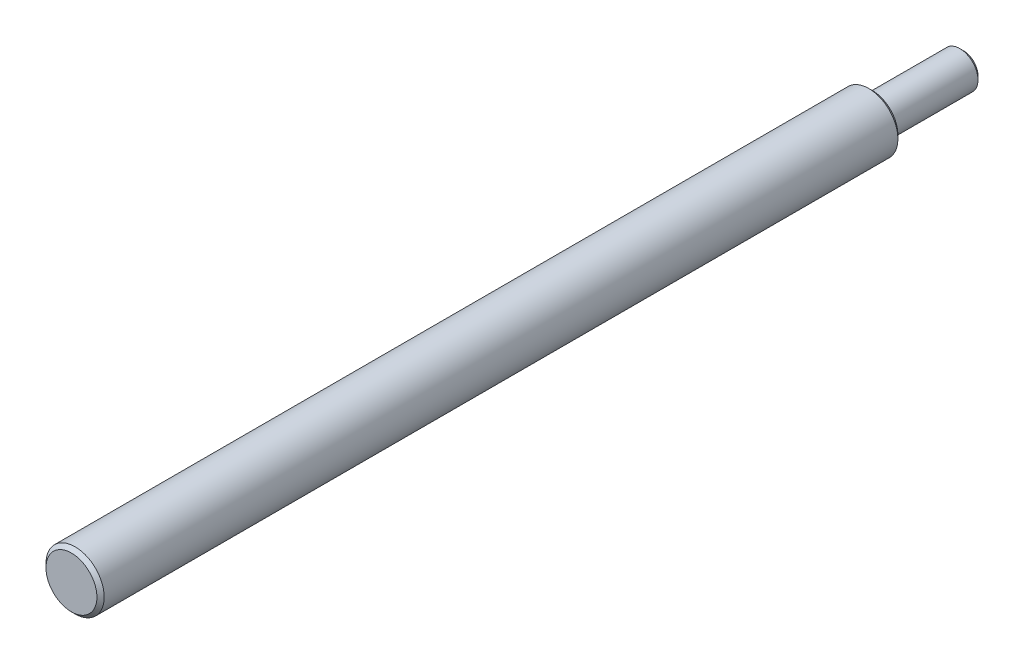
from build123d import *

# Parameters (mm, degrees)
SKETCH_1_R      = 8
EXTRUDE_1_DEPTH = 220
SKETCH_2_R      = 5
EXTRUDE_2_DEPTH = 25
CHAMFER_1_SIZE  = 1


with BuildPart() as part:
    # Sketch 1 → Extrude 1 (new body)
    with BuildSketch(Plane.XY):
        Circle(SKETCH_1_R)
    extrude(amount=EXTRUDE_1_DEPTH)

    # Sketch 2 → Extrude 2 (add)
    with BuildSketch(Plane(origin=(0, 0, 0), x_dir=(-1, 0, 0), z_dir=(0, 0, -1))):
        with Locations(Location((0, 0, 0), (0, 0, 180))):
            Circle(SKETCH_2_R)
    extrude(amount=EXTRUDE_2_DEPTH)

    # Chamfer 1
    chamfer_1_edges = [part.edges().sort_by_distance(p)[0] for p in [
        (-8, 0, 0),
        (-8, 0, 220),
        (-5, 0, -25),
    ]]
    chamfer(chamfer_1_edges, length=CHAMFER_1_SIZE)


solid = part.part
